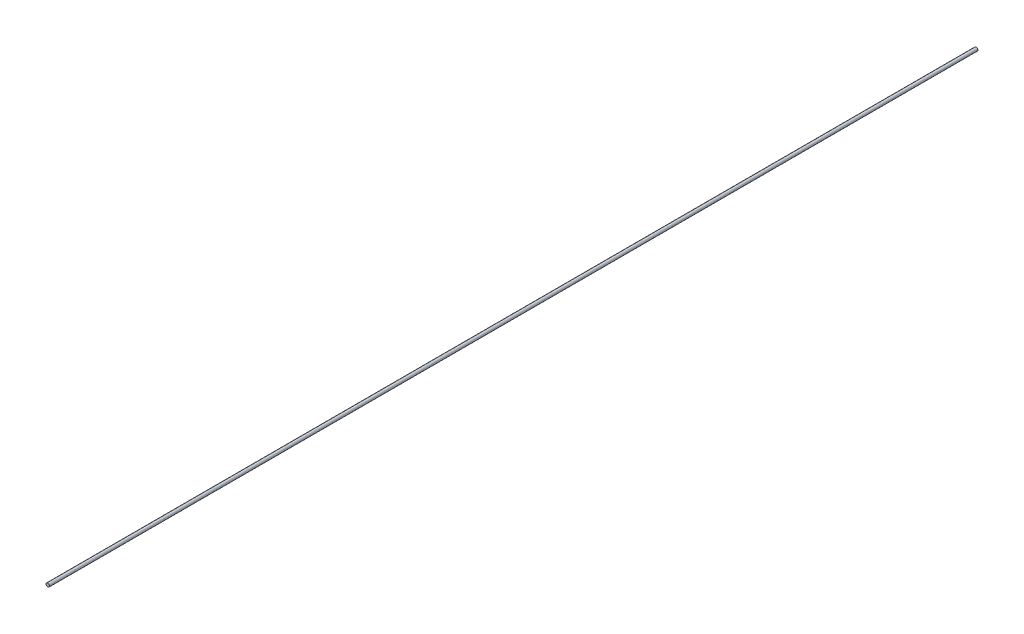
from build123d import *

# Parameters (mm, degrees)
SKETCH1_R           = 1.9812
BOSS_EXTRUDE1_DEPTH = 1066.8


with BuildPart() as part:
    # Sketch1 → Boss-Extrude1 (new body)
    with BuildSketch(Plane.XY):
        Circle(SKETCH1_R)
    extrude(amount=BOSS_EXTRUDE1_DEPTH)


solid = part.part
